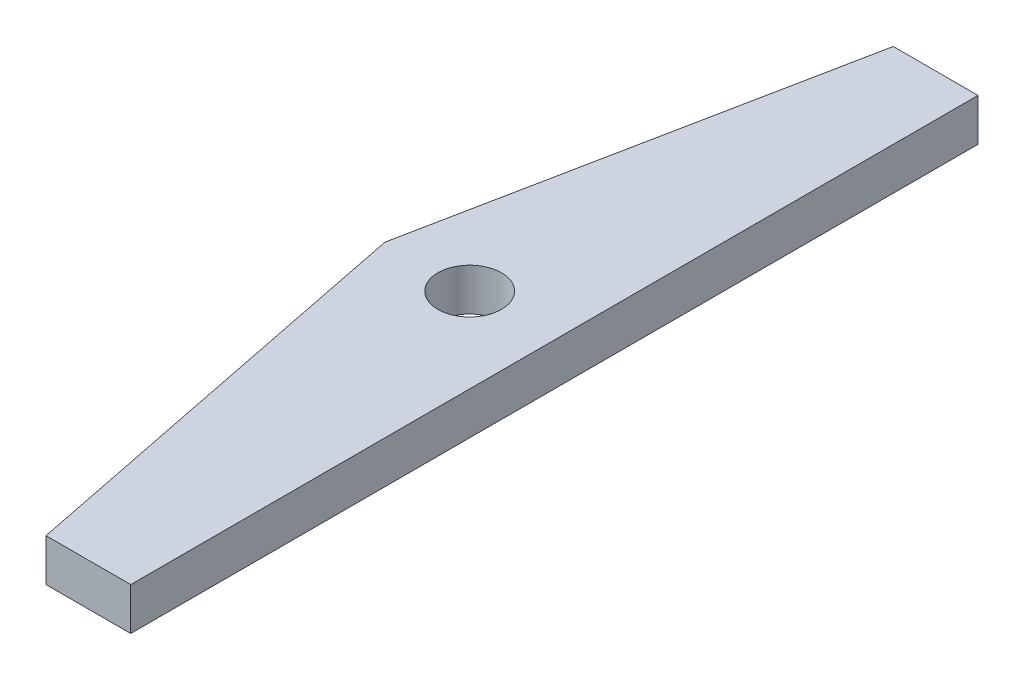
from build123d import *

# Parameters (mm, degrees)
SKETCH1_R      = 2.25
EXTRUDE1_DEPTH = 3


with BuildPart() as part:
    # Sketch1 → Extrude1 (new body)
    with BuildSketch(Plane(origin=(0, 0, 0), x_dir=(1, 0, 0), z_dir=(0, 1, 0))):
        Polygon((0, -30), (0, 30), (-6, 30), (-12, 0), (-6, -30), align=None)
        with Locations(Location((-6, 0, 0), (0, 0, 270))):
            Circle(SKETCH1_R, mode=Mode.SUBTRACT)
    extrude(amount=EXTRUDE1_DEPTH)


solid = part.part
